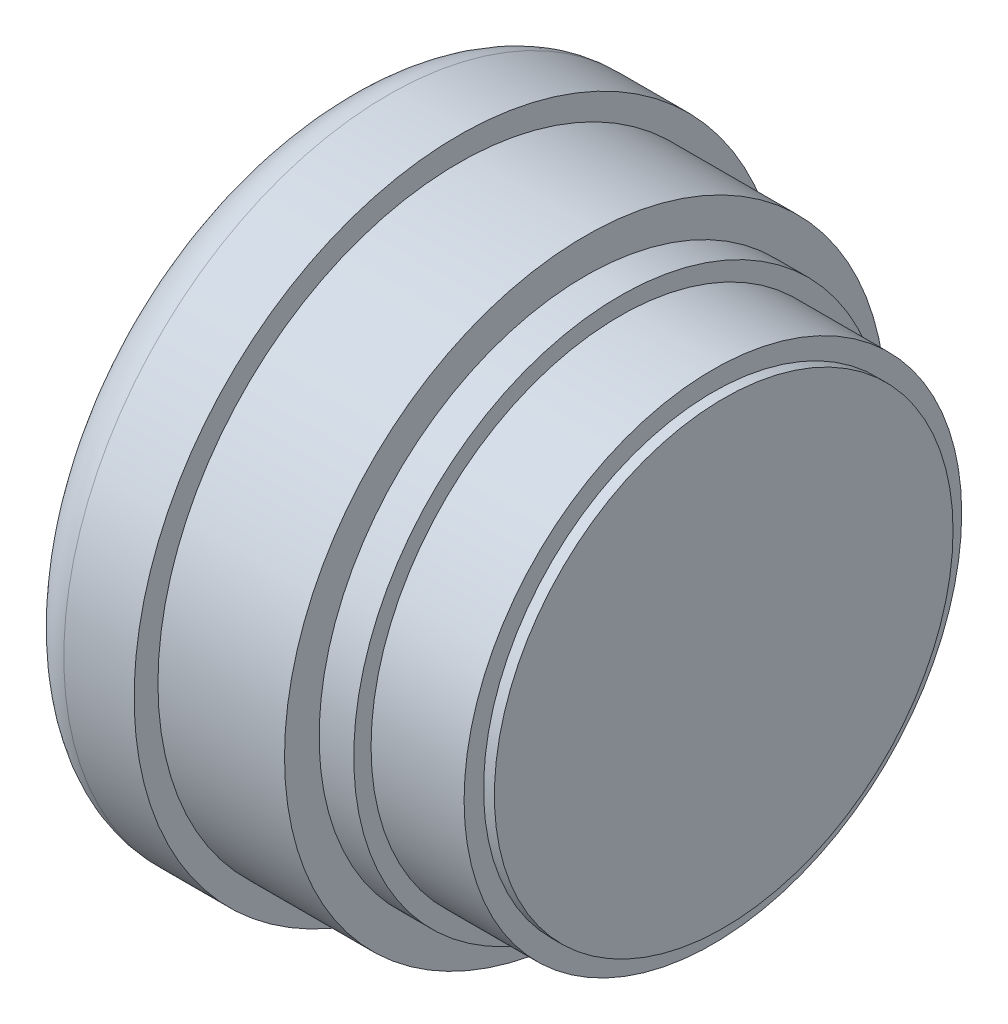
ISO-10303-21;
HEADER;
FILE_DESCRIPTION(('STEP AP214'),'2;1');
FILE_NAME('part.step','',(''),(''),'','','');
FILE_SCHEMA(('AUTOMOTIVE_DESIGN { 1 0 10303 214 1 1 1 1 }'));
ENDSEC;
DATA;
#1=APPLICATION_CONTEXT('core data for automotive mechanical design processes');
#2=APPLICATION_PROTOCOL_DEFINITION('international standard','automotive_design',2000,#1);
#3=PRODUCT_CONTEXT('',#1,'mechanical');
#4=PRODUCT('Part','Part','',(#3));
#5=PRODUCT_RELATED_PRODUCT_CATEGORY('part','',(#4));
#6=PRODUCT_DEFINITION_FORMATION('','',#4);
#7=PRODUCT_DEFINITION_CONTEXT('part definition',#1,'design');
#8=PRODUCT_DEFINITION('design','',#6,#7);
#9=PRODUCT_DEFINITION_SHAPE('','',#8);
#10=(LENGTH_UNIT() NAMED_UNIT(*) SI_UNIT(.MILLI.,.METRE.));
#11=(NAMED_UNIT(*) PLANE_ANGLE_UNIT() SI_UNIT($,.RADIAN.));
#12=(NAMED_UNIT(*) SI_UNIT($,.STERADIAN.) SOLID_ANGLE_UNIT());
#13=UNCERTAINTY_MEASURE_WITH_UNIT(LENGTH_MEASURE(1.E-05),#10,'distance_accuracy_value','');
#14=(GEOMETRIC_REPRESENTATION_CONTEXT(3) GLOBAL_UNCERTAINTY_ASSIGNED_CONTEXT((#13)) GLOBAL_UNIT_ASSIGNED_CONTEXT((#10,
#11,#12)) REPRESENTATION_CONTEXT('',''));
#15=CARTESIAN_POINT('',(0.,0.,0.));
#16=DIRECTION('',(0.,0.,1.));
#17=DIRECTION('',(1.,0.,0.));
#18=AXIS2_PLACEMENT_3D('',#15,#16,#17);
#19=CARTESIAN_POINT('',(0.,0.,0.));
#20=DIRECTION('',(1.,0.,0.));
#21=DIRECTION('',(0.,0.,-1.));
#22=AXIS2_PLACEMENT_3D('',#19,#20,#21);
#23=CYLINDRICAL_SURFACE('',#22,11.5);
#24=CARTESIAN_POINT('',(-4.8,0.,0.));
#25=DIRECTION('',(1.,0.,0.));
#26=DIRECTION('',(0.,0.,-1.));
#27=AXIS2_PLACEMENT_3D('',#24,#25,#26);
#28=CIRCLE('',#27,11.5);
#29=CARTESIAN_POINT('',(-4.8,0.,-11.5));
#30=VERTEX_POINT('',#29);
#31=EDGE_CURVE('E98',#30,#30,#28,.T.);
#32=ORIENTED_EDGE('',*,*,#31,.T.);
#33=EDGE_LOOP('',(#32));
#34=FACE_BOUND('',#33,.T.);
#35=CARTESIAN_POINT('',(-0.5,0.,0.));
#36=DIRECTION('',(1.,0.,0.));
#37=DIRECTION('',(0.,0.,-1.));
#38=AXIS2_PLACEMENT_3D('',#35,#36,#37);
#39=CIRCLE('',#38,11.5);
#40=CARTESIAN_POINT('',(-0.5,0.,-11.5));
#41=VERTEX_POINT('',#40);
#42=EDGE_CURVE('E11',#41,#41,#39,.T.);
#43=ORIENTED_EDGE('',*,*,#42,.F.);
#44=EDGE_LOOP('',(#43));
#45=FACE_BOUND('',#44,.T.);
#46=ADVANCED_FACE('F17',(#34,#45),#23,.T.);
#47=CARTESIAN_POINT('',(-0.500000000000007,11.5,0.));
#48=DIRECTION('',(1.,0.,0.));
#49=DIRECTION('',(0.,0.,-1.));
#50=AXIS2_PLACEMENT_3D('',#47,#48,#49);
#51=PLANE('',#50);
#52=ORIENTED_EDGE('',*,*,#42,.T.);
#53=EDGE_LOOP('',(#52));
#54=FACE_BOUND('',#53,.T.);
#55=CARTESIAN_POINT('',(-0.5,0.,0.));
#56=DIRECTION('',(1.,0.,0.));
#57=DIRECTION('',(0.,0.,-1.));
#58=AXIS2_PLACEMENT_3D('',#55,#56,#57);
#59=CIRCLE('',#58,10.6);
#60=CARTESIAN_POINT('',(-0.5,0.,-10.6));
#61=VERTEX_POINT('',#60);
#62=EDGE_CURVE('E25',#61,#61,#59,.T.);
#63=ORIENTED_EDGE('',*,*,#62,.F.);
#64=EDGE_LOOP('',(#63));
#65=FACE_BOUND('',#64,.T.);
#66=ADVANCED_FACE('F52',(#54,#65),#51,.T.);
#67=CARTESIAN_POINT('',(0.,0.,0.));
#68=DIRECTION('',(1.,0.,0.));
#69=DIRECTION('',(0.,0.,-1.));
#70=AXIS2_PLACEMENT_3D('',#67,#68,#69);
#71=CYLINDRICAL_SURFACE('',#70,10.6);
#72=ORIENTED_EDGE('',*,*,#62,.T.);
#73=EDGE_LOOP('',(#72));
#74=FACE_BOUND('',#73,.T.);
#75=CARTESIAN_POINT('',(0.,0.,0.));
#76=DIRECTION('',(1.,0.,0.));
#77=DIRECTION('',(0.,0.,-1.));
#78=AXIS2_PLACEMENT_3D('',#75,#76,#77);
#79=CIRCLE('',#78,10.6);
#80=CARTESIAN_POINT('',(0.,0.,-10.6));
#81=VERTEX_POINT('',#80);
#82=EDGE_CURVE('E36',#81,#81,#79,.T.);
#83=ORIENTED_EDGE('',*,*,#82,.F.);
#84=EDGE_LOOP('',(#83));
#85=FACE_BOUND('',#84,.T.);
#86=ADVANCED_FACE('F49',(#74,#85),#71,.T.);
#87=CARTESIAN_POINT('',(0.,10.6,0.));
#88=DIRECTION('',(1.,0.,0.));
#89=DIRECTION('',(0.,0.,-1.));
#90=AXIS2_PLACEMENT_3D('',#87,#88,#89);
#91=PLANE('',#90);
#92=ORIENTED_EDGE('',*,*,#82,.T.);
#93=EDGE_LOOP('',(#92));
#94=FACE_BOUND('',#93,.T.);
#95=ADVANCED_FACE('F31',(#94),#91,.T.);
#96=CARTESIAN_POINT('',(-15.5,0.,0.));
#97=DIRECTION('',(0.,-1.,0.));
#98=DIRECTION('',(0.,0.,-1.));
#99=AXIS2_PLACEMENT_3D('',#96,#97,#98);
#100=ELLIPSE('',#99,15.,5.);
#101=TRIMMED_CURVE('',#100,(PARAMETER_VALUE(4.71238898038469)),
(PARAMETER_VALUE(7.85398163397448)),.T.,.PARAMETER.);
#102=CARTESIAN_POINT('',(-10.5,0.,0.));
#103=DIRECTION('',(-1.,0.,0.));
#104=AXIS1_PLACEMENT('',#102,#103);
#105=SURFACE_OF_REVOLUTION('',#101,#104);
#106=CARTESIAN_POINT('',(-20.5,0.,0.));
#107=VERTEX_POINT('',#106);
#108=VERTEX_LOOP('',#107);
#109=FACE_BOUND('',#108,.T.);
#110=CARTESIAN_POINT('',(-15.5,0.,0.));
#111=DIRECTION('',(1.,0.,0.));
#112=DIRECTION('',(0.,0.,-1.));
#113=AXIS2_PLACEMENT_3D('',#110,#111,#112);
#114=CIRCLE('',#113,15.);
#115=CARTESIAN_POINT('',(-15.5,0.,-15.));
#116=VERTEX_POINT('',#115);
#117=EDGE_CURVE('E34',#116,#116,#114,.T.);
#118=ORIENTED_EDGE('',*,*,#117,.F.);
#119=EDGE_LOOP('',(#118));
#120=FACE_BOUND('',#119,.T.);
#121=ADVANCED_FACE('F19',(#109,#120),#105,.F.);
#122=CARTESIAN_POINT('',(0.,0.,0.));
#123=DIRECTION('',(1.,0.,0.));
#124=DIRECTION('',(0.,0.,-1.));
#125=AXIS2_PLACEMENT_3D('',#122,#123,#124);
#126=CYLINDRICAL_SURFACE('',#125,15.);
#127=ORIENTED_EDGE('',*,*,#117,.T.);
#128=EDGE_LOOP('',(#127));
#129=FACE_BOUND('',#128,.T.);
#130=CARTESIAN_POINT('',(-12.25,0.,0.));
#131=DIRECTION('',(1.,0.,0.));
#132=DIRECTION('',(0.,0.,-1.));
#133=AXIS2_PLACEMENT_3D('',#130,#131,#132);
#134=CIRCLE('',#133,15.);
#135=CARTESIAN_POINT('',(-12.25,0.,-15.));
#136=VERTEX_POINT('',#135);
#137=EDGE_CURVE('E37',#136,#136,#134,.T.);
#138=ORIENTED_EDGE('',*,*,#137,.F.);
#139=EDGE_LOOP('',(#138));
#140=FACE_BOUND('',#139,.T.);
#141=ADVANCED_FACE('F30',(#129,#140),#126,.T.);
#142=CARTESIAN_POINT('',(-12.25,13.9,0.));
#143=DIRECTION('',(1.,0.,0.));
#144=DIRECTION('',(0.,0.,-1.));
#145=AXIS2_PLACEMENT_3D('',#142,#143,#144);
#146=PLANE('',#145);
#147=ORIENTED_EDGE('',*,*,#137,.T.);
#148=EDGE_LOOP('',(#147));
#149=FACE_BOUND('',#148,.T.);
#150=CARTESIAN_POINT('',(-12.25,0.,0.));
#151=DIRECTION('',(1.,0.,0.));
#152=DIRECTION('',(0.,0.,-1.));
#153=AXIS2_PLACEMENT_3D('',#150,#151,#152);
#154=CIRCLE('',#153,13.9);
#155=CARTESIAN_POINT('',(-12.25,0.,-13.9));
#156=VERTEX_POINT('',#155);
#157=EDGE_CURVE('E42',#156,#156,#154,.T.);
#158=ORIENTED_EDGE('',*,*,#157,.F.);
#159=EDGE_LOOP('',(#158));
#160=FACE_BOUND('',#159,.T.);
#161=ADVANCED_FACE('F70',(#149,#160),#146,.T.);
#162=CARTESIAN_POINT('',(0.,0.,0.));
#163=DIRECTION('',(1.,0.,0.));
#164=DIRECTION('',(0.,0.,-1.));
#165=AXIS2_PLACEMENT_3D('',#162,#163,#164);
#166=CYLINDRICAL_SURFACE('',#165,13.9);
#167=ORIENTED_EDGE('',*,*,#157,.T.);
#168=EDGE_LOOP('',(#167));
#169=FACE_BOUND('',#168,.T.);
#170=CARTESIAN_POINT('',(-6.4,0.,0.));
#171=DIRECTION('',(1.,0.,0.));
#172=DIRECTION('',(0.,0.,-1.));
#173=AXIS2_PLACEMENT_3D('',#170,#171,#172);
#174=CIRCLE('',#173,13.9);
#175=CARTESIAN_POINT('',(-6.4,0.,-13.9));
#176=VERTEX_POINT('',#175);
#177=EDGE_CURVE('E105',#176,#176,#174,.T.);
#178=ORIENTED_EDGE('',*,*,#177,.F.);
#179=EDGE_LOOP('',(#178));
#180=FACE_BOUND('',#179,.T.);
#181=ADVANCED_FACE('F73',(#169,#180),#166,.T.);
#182=CARTESIAN_POINT('',(-6.4,13.9,0.));
#183=DIRECTION('',(1.,0.,0.));
#184=DIRECTION('',(0.,0.,-1.));
#185=AXIS2_PLACEMENT_3D('',#182,#183,#184);
#186=PLANE('',#185);
#187=ORIENTED_EDGE('',*,*,#177,.T.);
#188=EDGE_LOOP('',(#187));
#189=FACE_BOUND('',#188,.T.);
#190=CARTESIAN_POINT('',(-6.4,0.,0.));
#191=DIRECTION('',(1.,0.,0.));
#192=DIRECTION('',(0.,0.,-1.));
#193=AXIS2_PLACEMENT_3D('',#190,#191,#192);
#194=CIRCLE('',#193,12.3);
#195=CARTESIAN_POINT('',(-6.4,0.,-12.3));
#196=VERTEX_POINT('',#195);
#197=EDGE_CURVE('E100',#196,#196,#194,.T.);
#198=ORIENTED_EDGE('',*,*,#197,.F.);
#199=EDGE_LOOP('',(#198));
#200=FACE_BOUND('',#199,.T.);
#201=ADVANCED_FACE('F77',(#189,#200),#186,.T.);
#202=CARTESIAN_POINT('',(0.,0.,0.));
#203=DIRECTION('',(1.,0.,0.));
#204=DIRECTION('',(0.,0.,-1.));
#205=AXIS2_PLACEMENT_3D('',#202,#203,#204);
#206=CYLINDRICAL_SURFACE('',#205,12.3);
#207=ORIENTED_EDGE('',*,*,#197,.T.);
#208=EDGE_LOOP('',(#207));
#209=FACE_BOUND('',#208,.T.);
#210=CARTESIAN_POINT('',(-4.8,0.,0.));
#211=DIRECTION('',(1.,0.,0.));
#212=DIRECTION('',(0.,0.,-1.));
#213=AXIS2_PLACEMENT_3D('',#210,#211,#212);
#214=CIRCLE('',#213,12.3);
#215=CARTESIAN_POINT('',(-4.8,0.,-12.3));
#216=VERTEX_POINT('',#215);
#217=EDGE_CURVE('E95',#216,#216,#214,.T.);
#218=ORIENTED_EDGE('',*,*,#217,.F.);
#219=EDGE_LOOP('',(#218));
#220=FACE_BOUND('',#219,.T.);
#221=ADVANCED_FACE('F81',(#209,#220),#206,.T.);
#222=CARTESIAN_POINT('',(-4.8,12.3,0.));
#223=DIRECTION('',(1.,0.,0.));
#224=DIRECTION('',(0.,0.,-1.));
#225=AXIS2_PLACEMENT_3D('',#222,#223,#224);
#226=PLANE('',#225);
#227=ORIENTED_EDGE('',*,*,#217,.T.);
#228=EDGE_LOOP('',(#227));
#229=FACE_BOUND('',#228,.T.);
#230=ORIENTED_EDGE('',*,*,#31,.F.);
#231=EDGE_LOOP('',(#230));
#232=FACE_BOUND('',#231,.T.);
#233=ADVANCED_FACE('F85',(#229,#232),#226,.T.);
#234=CLOSED_SHELL('',(#46,#66,#86,#95,#121,#141,#161,#181,#201,#221,#233));
#235=MANIFOLD_SOLID_BREP('B1',#234);
#236=ADVANCED_BREP_SHAPE_REPRESENTATION('',(#18,#235),#14);
#237=SHAPE_DEFINITION_REPRESENTATION(#9,#236);
ENDSEC;
END-ISO-10303-21;
